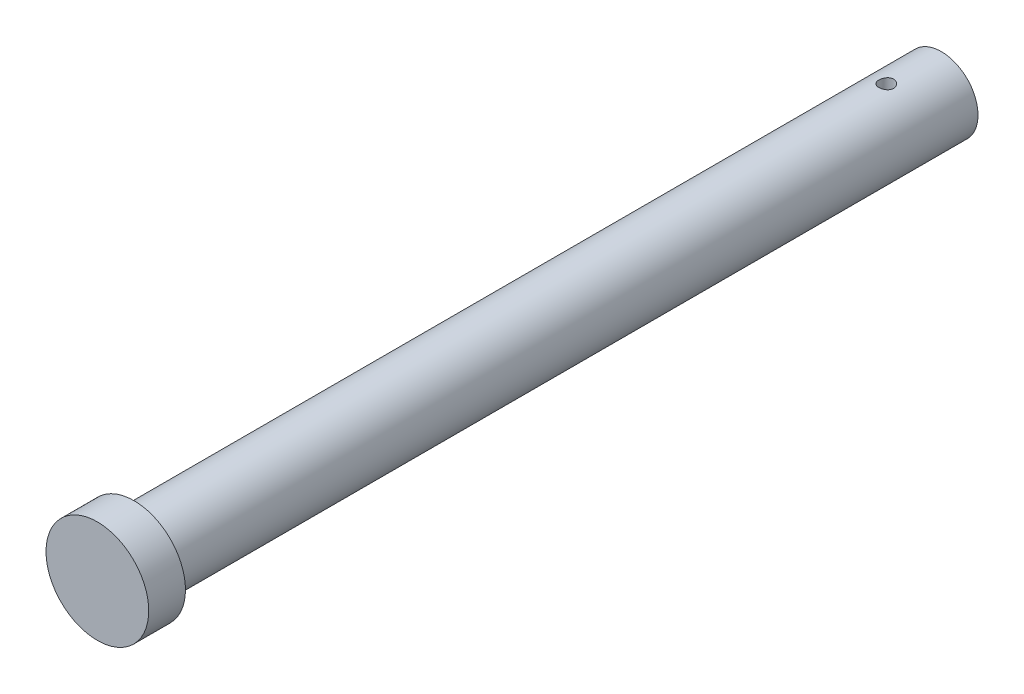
from build123d import *

# Parameters (mm, degrees)
LINEAR_AUSTRAGEN1_DEPTH              = 75
LINEAR_AUSTRAGEN1_DEPTH_BACK         = 35
SKIZZE1_R                            = 5
SKIZZE2_R                            = 7
LINEAR_AUSTRAGEN2_DEPTH              = 5
SCHNITT_LINEAR_AUSTRAGEN1_DEPTH      = 30
SCHNITT_LINEAR_AUSTRAGEN1_DEPTH_BACK = 10
SKIZZE3_R                            = 1


with BuildPart() as part:
    # Skizze1 → Linear austragen1 (new, two sides: drawn at the far end of the back side and taken through both)
    with BuildSketch(Plane.XY.offset(-LINEAR_AUSTRAGEN1_DEPTH_BACK)):
        Circle(SKIZZE1_R)
    extrude(amount=LINEAR_AUSTRAGEN1_DEPTH + LINEAR_AUSTRAGEN1_DEPTH_BACK)

    # Skizze2 → Linear austragen2 (add)
    with BuildSketch(Plane.XY.offset(75)):
        with Locations(Location((0, 0, 0), (0, 0, 180))):
            Circle(SKIZZE2_R)
    extrude(amount=LINEAR_AUSTRAGEN2_DEPTH)

    # Skizze3 → Schnitt-Linear austragen1 (cut, two sides: drawn at the far end of the back side and taken through both)
    with BuildSketch(Plane(origin=(0, 0, 0), x_dir=(1, 0, 0), z_dir=(0, 1, 0)).offset(-SCHNITT_LINEAR_AUSTRAGEN1_DEPTH_BACK)):
        with Locations(Location((0, 27.5, 0), (0, 0, 270))):
            Circle(SKIZZE3_R)
    extrude(amount=SCHNITT_LINEAR_AUSTRAGEN1_DEPTH + SCHNITT_LINEAR_AUSTRAGEN1_DEPTH_BACK, mode=Mode.SUBTRACT)


solid = part.part
